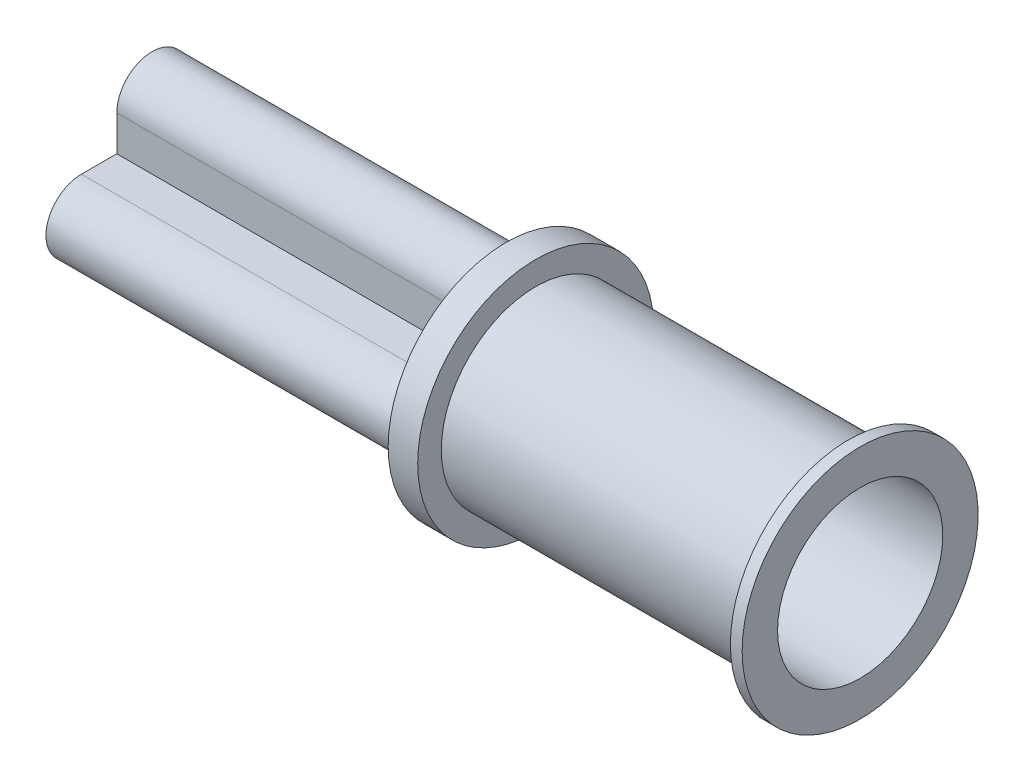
from build123d import *

# Parameters (mm, degrees)
BOSS_EXTRUDE1_DEPTH = 7.62


with BuildPart() as part:
    # Sketch1 → Revolve1 (revolve)
    with BuildSketch(Plane.XY, mode=Mode.PRIVATE) as revolve1_sk:
        Polygon((0, 1.778), (0, 2.54), (0.635, 2.54), (0.635, 2.032), (7.366, 2.032), (7.366, 2.54), (7.62, 2.54), (7.62, 1.778), (0.635, 1.778), (0.635, 0), (0, 0), align=None)
    revolve(revolve1_sk.sketch.rotate(Axis((0, 0, 0), (1, 0, 0)), 90), axis=Axis((0, 0, 0), (1, 0, 0)))

    # Sketch3 → Boss-Extrude1 (add)
    with BuildSketch(Plane(origin=(0, 0, 0), x_dir=(0, 0, -1), z_dir=(1, 0, 0))):
        with BuildLine():
            Line((-1.524, 0.762), (-0.762, 0.762))
            Line((-0.762, 0.762), (-0.762, 1.524))
            ThreePointArc((-0.762, 1.524), (0, 2.286), (0.762, 1.524))
            Line((0.762, 1.524), (0.762, 0.762))
            Line((0.762, 0.762), (1.524, 0.762))
            ThreePointArc((1.524, 0.762), (2.286, 0), (1.524, -0.762))
            Line((1.524, -0.762), (0.762, -0.762))
            Line((0.762, -0.762), (0.762, -1.524))
            ThreePointArc((0.762, -1.524), (0, -2.286), (-0.762, -1.524))
            Line((-0.762, -1.524), (-0.762, -0.762))
            Line((-0.762, -0.762), (-1.524, -0.762))
            ThreePointArc((-1.524, -0.762), (-2.286, 0), (-1.524, 0.762))
        make_face()
    extrude(amount=-BOSS_EXTRUDE1_DEPTH)


solid = part.part
